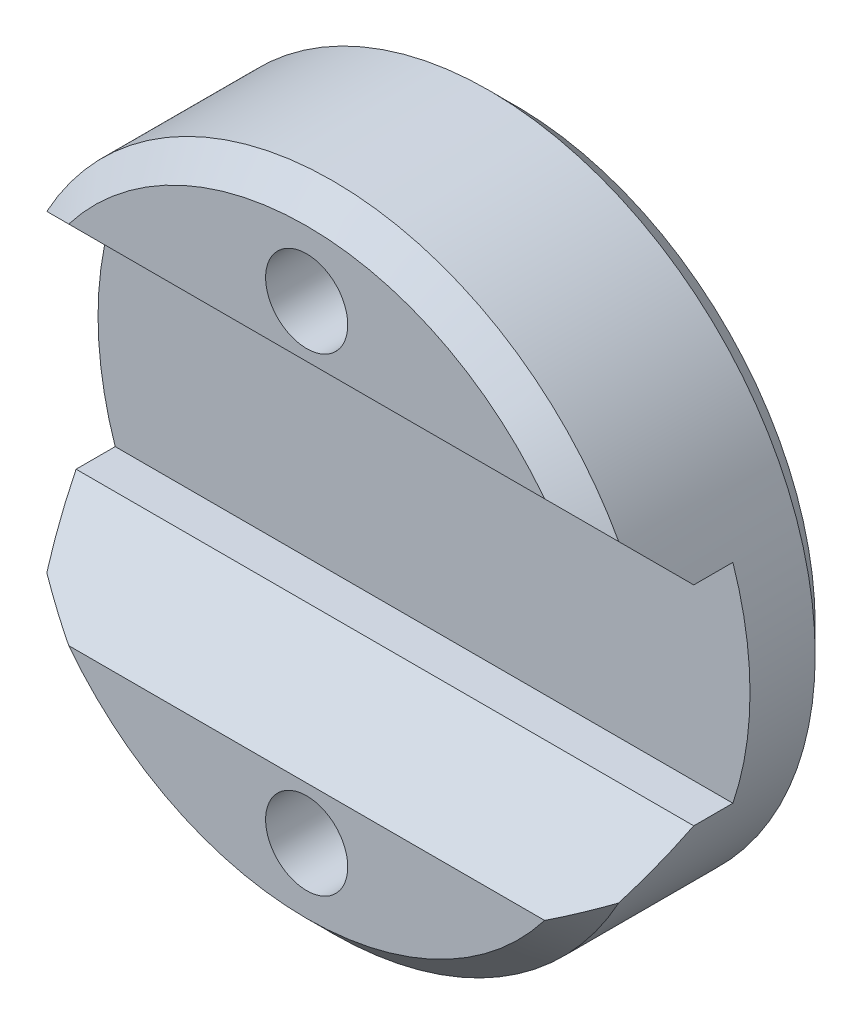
ISO-10303-21;
HEADER;
FILE_DESCRIPTION(('STEP AP214'),'2;1');
FILE_NAME('part.step','',(''),(''),'','','');
FILE_SCHEMA(('AUTOMOTIVE_DESIGN { 1 0 10303 214 1 1 1 1 }'));
ENDSEC;
DATA;
#1=APPLICATION_CONTEXT('core data for automotive mechanical design processes');
#2=APPLICATION_PROTOCOL_DEFINITION('international standard','automotive_design',2000,#1);
#3=PRODUCT_CONTEXT('',#1,'mechanical');
#4=PRODUCT('Part','Part','',(#3));
#5=PRODUCT_RELATED_PRODUCT_CATEGORY('part','',(#4));
#6=PRODUCT_DEFINITION_FORMATION('','',#4);
#7=PRODUCT_DEFINITION_CONTEXT('part definition',#1,'design');
#8=PRODUCT_DEFINITION('design','',#6,#7);
#9=PRODUCT_DEFINITION_SHAPE('','',#8);
#10=(LENGTH_UNIT() NAMED_UNIT(*) SI_UNIT(.MILLI.,.METRE.));
#11=(NAMED_UNIT(*) PLANE_ANGLE_UNIT() SI_UNIT($,.RADIAN.));
#12=(NAMED_UNIT(*) SI_UNIT($,.STERADIAN.) SOLID_ANGLE_UNIT());
#13=UNCERTAINTY_MEASURE_WITH_UNIT(LENGTH_MEASURE(1.E-05),#10,'distance_accuracy_value','');
#14=(GEOMETRIC_REPRESENTATION_CONTEXT(3) GLOBAL_UNCERTAINTY_ASSIGNED_CONTEXT((#13)) GLOBAL_UNIT_ASSIGNED_CONTEXT((#10,
#11,#12)) REPRESENTATION_CONTEXT('',''));
#15=CARTESIAN_POINT('',(0.,0.,0.));
#16=DIRECTION('',(0.,0.,1.));
#17=DIRECTION('',(1.,0.,0.));
#18=AXIS2_PLACEMENT_3D('',#15,#16,#17);
#19=CARTESIAN_POINT('',(0.,0.,16.));
#20=DIRECTION('',(0.,0.,1.));
#21=DIRECTION('',(1.,0.,0.));
#22=AXIS2_PLACEMENT_3D('',#19,#20,#21);
#23=PLANE('',#22);
#24=CARTESIAN_POINT('',(0.,0.,16.));
#25=DIRECTION('',(0.,0.,1.));
#26=DIRECTION('',(1.,0.,0.));
#27=AXIS2_PLACEMENT_3D('',#24,#25,#26);
#28=CIRCLE('',#27,23.);
#29=CARTESIAN_POINT('',(18.2482875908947,14.,16.));
#30=VERTEX_POINT('',#29);
#31=CARTESIAN_POINT('',(-18.2482875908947,14.,16.));
#32=VERTEX_POINT('',#31);
#33=EDGE_CURVE('E177',#30,#32,#28,.T.);
#34=ORIENTED_EDGE('',*,*,#33,.T.);
#35=DIRECTION('',(1.,0.,0.));
#36=VECTOR('',#35,1.);
#37=CARTESIAN_POINT('',(21.5638586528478,14.,16.));
#38=LINE('',#37,#36);
#39=EDGE_CURVE('E132',#32,#30,#38,.T.);
#40=ORIENTED_EDGE('',*,*,#39,.T.);
#41=EDGE_LOOP('',(#34,#40));
#42=FACE_BOUND('',#41,.T.);
#43=CARTESIAN_POINT('',(0.,18.,16.));
#44=DIRECTION('',(0.,0.,1.));
#45=DIRECTION('',(1.,0.,0.));
#46=AXIS2_PLACEMENT_3D('',#43,#44,#45);
#47=CIRCLE('',#46,3.15);
#48=CARTESIAN_POINT('',(3.15,18.,16.));
#49=VERTEX_POINT('',#48);
#50=EDGE_CURVE('E158',#49,#49,#47,.T.);
#51=ORIENTED_EDGE('',*,*,#50,.F.);
#52=EDGE_LOOP('',(#51));
#53=FACE_BOUND('',#52,.T.);
#54=ADVANCED_FACE('F41',(#42,#53),#23,.T.);
#55=CARTESIAN_POINT('',(0.,0.,16.));
#56=DIRECTION('',(0.,0.,-1.));
#57=DIRECTION('',(-1.,0.,0.));
#58=AXIS2_PLACEMENT_3D('',#55,#56,#57);
#59=CONICAL_SURFACE('',#58,23.,0.785398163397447);
#60=ORIENTED_EDGE('',*,*,#33,.F.);
#61=CARTESIAN_POINT('',(18.2482875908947,14.,16.));
#62=CARTESIAN_POINT('',(18.5659052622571,13.8433489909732,15.8433489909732));
#63=CARTESIAN_POINT('',(18.8808036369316,13.6839552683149,15.6839552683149));
#64=CARTESIAN_POINT('',(19.5051164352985,13.3601064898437,15.3601064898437));
#65=CARTESIAN_POINT('',(19.814533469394,13.1956539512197,15.1956539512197));
#66=CARTESIAN_POINT('',(20.428132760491,12.8619664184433,14.8619664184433));
#67=CARTESIAN_POINT('',(20.7323152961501,12.6927316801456,14.6927316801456));
#68=CARTESIAN_POINT('',(21.3357336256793,12.3496957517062,14.3496957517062));
#69=CARTESIAN_POINT('',(21.634966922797,12.1758923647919,14.1758923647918));
#70=CARTESIAN_POINT('',(21.9317121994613,12.,14.));
#71=B_SPLINE_CURVE_WITH_KNOTS('',3,(#61,#62,#63,#64,#65,#66,#67,#68,#69,#70),.UNSPECIFIED.,.F.,
.F.,(4,2,2,2,4),(0.,1.16169500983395,2.32282104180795,3.48388506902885,4.64551797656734),.UNSPECIFIED.);
#72=CARTESIAN_POINT('',(21.9317121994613,12.,14.));
#73=VERTEX_POINT('',#72);
#74=EDGE_CURVE('E195',#30,#73,#71,.T.);
#75=ORIENTED_EDGE('',*,*,#74,.T.);
#76=CARTESIAN_POINT('',(0.,0.,14.));
#77=DIRECTION('',(0.,0.,1.));
#78=DIRECTION('',(1.,0.,0.));
#79=AXIS2_PLACEMENT_3D('',#76,#77,#78);
#80=CIRCLE('',#79,25.);
#81=CARTESIAN_POINT('',(-21.9317121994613,12.,14.));
#82=VERTEX_POINT('',#81);
#83=EDGE_CURVE('E180',#82,#73,#80,.F.);
#84=ORIENTED_EDGE('',*,*,#83,.F.);
#85=CARTESIAN_POINT('',(-21.9317121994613,12.,14.));
#86=CARTESIAN_POINT('',(-21.634966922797,12.1758923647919,14.1758923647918));
#87=CARTESIAN_POINT('',(-21.3357336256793,12.3496957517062,14.3496957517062));
#88=CARTESIAN_POINT('',(-20.7323152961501,12.6927316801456,14.6927316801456));
#89=CARTESIAN_POINT('',(-20.428132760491,12.8619664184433,14.8619664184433));
#90=CARTESIAN_POINT('',(-19.814533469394,13.1956539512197,15.1956539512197));
#91=CARTESIAN_POINT('',(-19.5051164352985,13.3601064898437,15.3601064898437));
#92=CARTESIAN_POINT('',(-18.8808036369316,13.6839552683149,15.6839552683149));
#93=CARTESIAN_POINT('',(-18.5659052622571,13.8433489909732,15.8433489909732));
#94=CARTESIAN_POINT('',(-18.2482875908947,14.,16.));
#95=B_SPLINE_CURVE_WITH_KNOTS('',3,(#85,#86,#87,#88,#89,#90,#91,#92,#93,#94),.UNSPECIFIED.,.F.,
.F.,(4,2,2,2,4),(0.,1.16163290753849,2.32269693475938,3.48382296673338,4.64551797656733),.UNSPECIFIED.);
#96=EDGE_CURVE('E186',#82,#32,#95,.T.);
#97=ORIENTED_EDGE('',*,*,#96,.T.);
#98=EDGE_LOOP('',(#60,#75,#84,#97));
#99=FACE_BOUND('',#98,.T.);
#100=ADVANCED_FACE('F223',(#99),#59,.T.);
#101=CARTESIAN_POINT('',(0.,0.,16.));
#102=DIRECTION('',(0.,0.,-1.));
#103=DIRECTION('',(-1.,0.,0.));
#104=AXIS2_PLACEMENT_3D('',#101,#102,#103);
#105=CYLINDRICAL_SURFACE('',#104,25.);
#106=ORIENTED_EDGE('',*,*,#83,.T.);
#107=CARTESIAN_POINT('',(0.,0.,1.99999999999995));
#108=DIRECTION('',(0.,-0.707106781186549,0.707106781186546));
#109=DIRECTION('',(0.,-0.707106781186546,-0.707106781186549));
#110=AXIS2_PLACEMENT_3D('',#107,#108,#109);
#111=ELLIPSE('',#110,35.3553390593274,25.);
#112=CARTESIAN_POINT('',(23.685438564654,8.,9.99999999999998));
#113=VERTEX_POINT('',#112);
#114=EDGE_CURVE('E359',#73,#113,#111,.F.);
#115=ORIENTED_EDGE('',*,*,#114,.T.);
#116=DIRECTION('',(0.,0.,-1.));
#117=VECTOR('',#116,1.);
#118=CARTESIAN_POINT('',(23.685438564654,8.,16.));
#119=LINE('',#118,#117);
#120=CARTESIAN_POINT('',(23.685438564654,8.,7.));
#121=VERTEX_POINT('',#120);
#122=EDGE_CURVE('E147',#113,#121,#119,.T.);
#123=ORIENTED_EDGE('',*,*,#122,.T.);
#124=CARTESIAN_POINT('',(0.,0.,7.));
#125=DIRECTION('',(0.,0.,-1.));
#126=DIRECTION('',(0.,1.,0.));
#127=AXIS2_PLACEMENT_3D('',#124,#125,#126);
#128=CIRCLE('',#127,25.);
#129=CARTESIAN_POINT('',(23.685438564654,-8.,7.));
#130=VERTEX_POINT('',#129);
#131=EDGE_CURVE('E133',#121,#130,#128,.T.);
#132=ORIENTED_EDGE('',*,*,#131,.T.);
#133=DIRECTION('',(0.,0.,-1.));
#134=VECTOR('',#133,1.);
#135=CARTESIAN_POINT('',(23.685438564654,-8.,16.));
#136=LINE('',#135,#134);
#137=CARTESIAN_POINT('',(23.685438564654,-8.,9.99999999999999));
#138=VERTEX_POINT('',#137);
#139=EDGE_CURVE('E120',#130,#138,#136,.F.);
#140=ORIENTED_EDGE('',*,*,#139,.T.);
#141=CARTESIAN_POINT('',(0.,0.,2.00000000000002));
#142=DIRECTION('',(0.,0.707106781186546,0.707106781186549));
#143=DIRECTION('',(0.,0.707106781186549,-0.707106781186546));
#144=AXIS2_PLACEMENT_3D('',#141,#142,#143);
#145=ELLIPSE('',#144,35.3553390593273,25.);
#146=CARTESIAN_POINT('',(21.9317121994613,-12.,14.));
#147=VERTEX_POINT('',#146);
#148=EDGE_CURVE('E365',#138,#147,#145,.F.);
#149=ORIENTED_EDGE('',*,*,#148,.T.);
#150=CARTESIAN_POINT('',(-21.9317121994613,-12.,14.));
#151=VERTEX_POINT('',#150);
#152=EDGE_CURVE('E178',#147,#151,#80,.F.);
#153=ORIENTED_EDGE('',*,*,#152,.T.);
#154=CARTESIAN_POINT('',(0.,0.,2.00000000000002));
#155=DIRECTION('',(0.,0.707106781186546,0.707106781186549));
#156=DIRECTION('',(0.,0.707106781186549,-0.707106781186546));
#157=AXIS2_PLACEMENT_3D('',#154,#155,#156);
#158=ELLIPSE('',#157,35.3553390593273,25.);
#159=CARTESIAN_POINT('',(-23.685438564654,-8.,9.99999999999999));
#160=VERTEX_POINT('',#159);
#161=EDGE_CURVE('E113',#151,#160,#158,.F.);
#162=ORIENTED_EDGE('',*,*,#161,.T.);
#163=DIRECTION('',(0.,0.,-1.));
#164=VECTOR('',#163,1.);
#165=CARTESIAN_POINT('',(-23.685438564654,-8.,16.));
#166=LINE('',#165,#164);
#167=CARTESIAN_POINT('',(-23.685438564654,-8.,7.));
#168=VERTEX_POINT('',#167);
#169=EDGE_CURVE('E105',#160,#168,#166,.T.);
#170=ORIENTED_EDGE('',*,*,#169,.T.);
#171=CARTESIAN_POINT('',(-23.685438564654,8.,7.));
#172=VERTEX_POINT('',#171);
#173=EDGE_CURVE('E110',#168,#172,#128,.T.);
#174=ORIENTED_EDGE('',*,*,#173,.T.);
#175=DIRECTION('',(0.,0.,-1.));
#176=VECTOR('',#175,1.);
#177=CARTESIAN_POINT('',(-23.685438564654,8.,16.));
#178=LINE('',#177,#176);
#179=CARTESIAN_POINT('',(-23.685438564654,8.,9.99999999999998));
#180=VERTEX_POINT('',#179);
#181=EDGE_CURVE('E119',#172,#180,#178,.F.);
#182=ORIENTED_EDGE('',*,*,#181,.T.);
#183=CARTESIAN_POINT('',(0.,0.,1.99999999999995));
#184=DIRECTION('',(0.,-0.707106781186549,0.707106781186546));
#185=DIRECTION('',(0.,-0.707106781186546,-0.707106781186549));
#186=AXIS2_PLACEMENT_3D('',#183,#184,#185);
#187=ELLIPSE('',#186,35.3553390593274,25.);
#188=EDGE_CURVE('E362',#180,#82,#187,.F.);
#189=ORIENTED_EDGE('',*,*,#188,.T.);
#190=EDGE_LOOP('',(#106,#115,#123,#132,#140,#149,#153,#162,#170,#174,#182,#189));
#191=FACE_BOUND('',#190,.T.);
#192=CARTESIAN_POINT('',(0.,0.,2.00000000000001));
#193=DIRECTION('',(0.,0.,1.));
#194=DIRECTION('',(1.,0.,0.));
#195=AXIS2_PLACEMENT_3D('',#192,#193,#194);
#196=CIRCLE('',#195,25.);
#197=CARTESIAN_POINT('',(25.,0.,2.00000000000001));
#198=VERTEX_POINT('',#197);
#199=EDGE_CURVE('E166',#198,#198,#196,.T.);
#200=ORIENTED_EDGE('',*,*,#199,.T.);
#201=EDGE_LOOP('',(#200));
#202=FACE_BOUND('',#201,.T.);
#203=ADVANCED_FACE('F43',(#191,#202),#105,.T.);
#204=CARTESIAN_POINT('',(-18.2482875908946,-14.,16.));
#205=VERTEX_POINT('',#204);
#206=CARTESIAN_POINT('',(18.2482875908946,-14.,16.));
#207=VERTEX_POINT('',#206);
#208=EDGE_CURVE('E174',#205,#207,#28,.T.);
#209=ORIENTED_EDGE('',*,*,#208,.T.);
#210=DIRECTION('',(-1.,0.,0.));
#211=VECTOR('',#210,1.);
#212=CARTESIAN_POINT('',(-21.5638586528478,-14.,16.));
#213=LINE('',#212,#211);
#214=EDGE_CURVE('E11',#207,#205,#213,.T.);
#215=ORIENTED_EDGE('',*,*,#214,.T.);
#216=EDGE_LOOP('',(#209,#215));
#217=FACE_BOUND('',#216,.T.);
#218=CARTESIAN_POINT('',(0.,-18.,16.));
#219=DIRECTION('',(0.,0.,1.));
#220=DIRECTION('',(1.,0.,0.));
#221=AXIS2_PLACEMENT_3D('',#218,#219,#220);
#222=CIRCLE('',#221,3.15);
#223=CARTESIAN_POINT('',(3.15,-18.,16.));
#224=VERTEX_POINT('',#223);
#225=EDGE_CURVE('E150',#224,#224,#222,.T.);
#226=ORIENTED_EDGE('',*,*,#225,.F.);
#227=EDGE_LOOP('',(#226));
#228=FACE_BOUND('',#227,.T.);
#229=ADVANCED_FACE('F225',(#217,#228),#23,.T.);
#230=CARTESIAN_POINT('',(0.,0.,0.));
#231=DIRECTION('',(0.,0.,1.));
#232=DIRECTION('',(1.,0.,0.));
#233=AXIS2_PLACEMENT_3D('',#230,#231,#232);
#234=PLANE('',#233);
#235=CARTESIAN_POINT('',(0.,0.,0.));
#236=DIRECTION('',(0.,0.,1.));
#237=DIRECTION('',(1.,0.,0.));
#238=AXIS2_PLACEMENT_3D('',#235,#236,#237);
#239=CIRCLE('',#238,23.);
#240=CARTESIAN_POINT('',(23.,0.,0.));
#241=VERTEX_POINT('',#240);
#242=EDGE_CURVE('E170',#241,#241,#239,.F.);
#243=ORIENTED_EDGE('',*,*,#242,.T.);
#244=EDGE_LOOP('',(#243));
#245=FACE_BOUND('',#244,.T.);
#246=CARTESIAN_POINT('',(0.,-18.,0.));
#247=DIRECTION('',(0.,0.,1.));
#248=DIRECTION('',(1.,0.,0.));
#249=AXIS2_PLACEMENT_3D('',#246,#247,#248);
#250=CIRCLE('',#249,3.15);
#251=CARTESIAN_POINT('',(3.15,-18.,0.));
#252=VERTEX_POINT('',#251);
#253=EDGE_CURVE('E154',#252,#252,#250,.T.);
#254=ORIENTED_EDGE('',*,*,#253,.T.);
#255=EDGE_LOOP('',(#254));
#256=FACE_BOUND('',#255,.T.);
#257=CARTESIAN_POINT('',(0.,18.,0.));
#258=DIRECTION('',(0.,0.,1.));
#259=DIRECTION('',(1.,0.,0.));
#260=AXIS2_PLACEMENT_3D('',#257,#258,#259);
#261=CIRCLE('',#260,3.15);
#262=CARTESIAN_POINT('',(3.15,18.,0.));
#263=VERTEX_POINT('',#262);
#264=EDGE_CURVE('E162',#263,#263,#261,.T.);
#265=ORIENTED_EDGE('',*,*,#264,.T.);
#266=EDGE_LOOP('',(#265));
#267=FACE_BOUND('',#266,.T.);
#268=ADVANCED_FACE('F234',(#245,#256,#267),#234,.F.);
#269=CARTESIAN_POINT('',(0.,18.,0.));
#270=DIRECTION('',(0.,0.,1.));
#271=DIRECTION('',(1.,0.,0.));
#272=AXIS2_PLACEMENT_3D('',#269,#270,#271);
#273=CYLINDRICAL_SURFACE('',#272,3.15);
#274=ORIENTED_EDGE('',*,*,#264,.F.);
#275=EDGE_LOOP('',(#274));
#276=FACE_BOUND('',#275,.T.);
#277=ORIENTED_EDGE('',*,*,#50,.T.);
#278=EDGE_LOOP('',(#277));
#279=FACE_BOUND('',#278,.T.);
#280=ADVANCED_FACE('F239',(#276,#279),#273,.F.);
#281=CARTESIAN_POINT('',(0.,-18.,0.));
#282=DIRECTION('',(0.,0.,1.));
#283=DIRECTION('',(1.,0.,0.));
#284=AXIS2_PLACEMENT_3D('',#281,#282,#283);
#285=CYLINDRICAL_SURFACE('',#284,3.15);
#286=ORIENTED_EDGE('',*,*,#253,.F.);
#287=EDGE_LOOP('',(#286));
#288=FACE_BOUND('',#287,.T.);
#289=ORIENTED_EDGE('',*,*,#225,.T.);
#290=EDGE_LOOP('',(#289));
#291=FACE_BOUND('',#290,.T.);
#292=ADVANCED_FACE('F244',(#288,#291),#285,.F.);
#293=CARTESIAN_POINT('',(0.,0.,2.00000000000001));
#294=DIRECTION('',(0.,0.,1.));
#295=DIRECTION('',(1.,0.,0.));
#296=AXIS2_PLACEMENT_3D('',#293,#294,#295);
#297=CONICAL_SURFACE('',#296,25.,0.78539816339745);
#298=ORIENTED_EDGE('',*,*,#242,.F.);
#299=EDGE_LOOP('',(#298));
#300=FACE_BOUND('',#299,.T.);
#301=ORIENTED_EDGE('',*,*,#199,.F.);
#302=EDGE_LOOP('',(#301));
#303=FACE_BOUND('',#302,.T.);
#304=ADVANCED_FACE('F246',(#300,#303),#297,.T.);
#305=ORIENTED_EDGE('',*,*,#152,.F.);
#306=CARTESIAN_POINT('',(21.9317121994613,-12.,14.));
#307=CARTESIAN_POINT('',(21.634966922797,-12.1758923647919,14.1758923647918));
#308=CARTESIAN_POINT('',(21.3357336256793,-12.3496957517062,14.3496957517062));
#309=CARTESIAN_POINT('',(20.7323152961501,-12.6927316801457,14.6927316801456));
#310=CARTESIAN_POINT('',(20.428132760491,-12.8619664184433,14.8619664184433));
#311=CARTESIAN_POINT('',(19.814533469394,-13.1956539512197,15.1956539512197));
#312=CARTESIAN_POINT('',(19.5051164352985,-13.3601064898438,15.3601064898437));
#313=CARTESIAN_POINT('',(18.8808036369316,-13.6839552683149,15.6839552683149));
#314=CARTESIAN_POINT('',(18.565905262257,-13.8433489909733,15.8433489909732));
#315=CARTESIAN_POINT('',(18.2482875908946,-14.,16.));
#316=B_SPLINE_CURVE_WITH_KNOTS('',3,(#306,#307,#308,#309,#310,#311,#312,#313,#314,#315),
.UNSPECIFIED.,.F.,.F.,(4,2,2,2,4),(0.,1.1616329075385,2.32269693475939,3.4838229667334,
4.64551797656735),.UNSPECIFIED.);
#317=EDGE_CURVE('E50',#147,#207,#316,.T.);
#318=ORIENTED_EDGE('',*,*,#317,.T.);
#319=ORIENTED_EDGE('',*,*,#208,.F.);
#320=CARTESIAN_POINT('',(-18.2482875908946,-14.,16.));
#321=CARTESIAN_POINT('',(-18.565905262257,-13.8433489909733,15.8433489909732));
#322=CARTESIAN_POINT('',(-18.8808036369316,-13.6839552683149,15.6839552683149));
#323=CARTESIAN_POINT('',(-19.5051164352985,-13.3601064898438,15.3601064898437));
#324=CARTESIAN_POINT('',(-19.814533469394,-13.1956539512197,15.1956539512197));
#325=CARTESIAN_POINT('',(-20.428132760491,-12.8619664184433,14.8619664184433));
#326=CARTESIAN_POINT('',(-20.7323152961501,-12.6927316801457,14.6927316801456));
#327=CARTESIAN_POINT('',(-21.3357336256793,-12.3496957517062,14.3496957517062));
#328=CARTESIAN_POINT('',(-21.634966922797,-12.1758923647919,14.1758923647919));
#329=CARTESIAN_POINT('',(-21.9317121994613,-12.,14.));
#330=B_SPLINE_CURVE_WITH_KNOTS('',3,(#320,#321,#322,#323,#324,#325,#326,#327,#328,#329),
.UNSPECIFIED.,.F.,.F.,(4,2,2,2,4),(0.,1.16169500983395,2.32282104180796,3.48388506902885,
4.64551797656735),.UNSPECIFIED.);
#331=EDGE_CURVE('E339',#205,#151,#330,.T.);
#332=ORIENTED_EDGE('',*,*,#331,.T.);
#333=EDGE_LOOP('',(#305,#318,#319,#332));
#334=FACE_BOUND('',#333,.T.);
#335=ADVANCED_FACE('F201',(#334),#59,.T.);
#336=CARTESIAN_POINT('',(-50.,8.,7.));
#337=DIRECTION('',(0.,0.,-1.));
#338=DIRECTION('',(0.,1.,0.));
#339=AXIS2_PLACEMENT_3D('',#336,#337,#338);
#340=PLANE('',#339);
#341=DIRECTION('',(1.,0.,0.));
#342=VECTOR('',#341,1.);
#343=CARTESIAN_POINT('',(-50.,8.,7.));
#344=LINE('',#343,#342);
#345=EDGE_CURVE('E130',#172,#121,#344,.T.);
#346=ORIENTED_EDGE('',*,*,#345,.F.);
#347=ORIENTED_EDGE('',*,*,#173,.F.);
#348=DIRECTION('',(1.,0.,0.));
#349=VECTOR('',#348,1.);
#350=CARTESIAN_POINT('',(-50.,-8.,7.));
#351=LINE('',#350,#349);
#352=EDGE_CURVE('E127',#168,#130,#351,.T.);
#353=ORIENTED_EDGE('',*,*,#352,.T.);
#354=ORIENTED_EDGE('',*,*,#131,.F.);
#355=EDGE_LOOP('',(#346,#347,#353,#354));
#356=FACE_BOUND('',#355,.T.);
#357=ADVANCED_FACE('F125',(#356),#340,.F.);
#358=CARTESIAN_POINT('',(-50.,8.,16.));
#359=DIRECTION('',(0.,1.,0.));
#360=DIRECTION('',(0.,0.,1.));
#361=AXIS2_PLACEMENT_3D('',#358,#359,#360);
#362=PLANE('',#361);
#363=ORIENTED_EDGE('',*,*,#122,.F.);
#364=DIRECTION('',(-1.,0.,0.));
#365=VECTOR('',#364,1.);
#366=CARTESIAN_POINT('',(-21.5638586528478,8.,9.99999999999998));
#367=LINE('',#366,#365);
#368=EDGE_CURVE('E346',#113,#180,#367,.T.);
#369=ORIENTED_EDGE('',*,*,#368,.T.);
#370=ORIENTED_EDGE('',*,*,#181,.F.);
#371=ORIENTED_EDGE('',*,*,#345,.T.);
#372=EDGE_LOOP('',(#363,#369,#370,#371));
#373=FACE_BOUND('',#372,.T.);
#374=ADVANCED_FACE('F213',(#373),#362,.F.);
#375=CARTESIAN_POINT('',(-50.,-8.,16.));
#376=DIRECTION('',(0.,-1.,0.));
#377=DIRECTION('',(0.,0.,-1.));
#378=AXIS2_PLACEMENT_3D('',#375,#376,#377);
#379=PLANE('',#378);
#380=ORIENTED_EDGE('',*,*,#169,.F.);
#381=DIRECTION('',(1.,0.,0.));
#382=VECTOR('',#381,1.);
#383=CARTESIAN_POINT('',(21.5638586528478,-8.,9.99999999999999));
#384=LINE('',#383,#382);
#385=EDGE_CURVE('E341',#160,#138,#384,.T.);
#386=ORIENTED_EDGE('',*,*,#385,.T.);
#387=ORIENTED_EDGE('',*,*,#139,.F.);
#388=ORIENTED_EDGE('',*,*,#352,.F.);
#389=EDGE_LOOP('',(#380,#386,#387,#388));
#390=FACE_BOUND('',#389,.T.);
#391=ADVANCED_FACE('F135',(#390),#379,.F.);
#392=CARTESIAN_POINT('',(0.,14.,16.));
#393=DIRECTION('',(0.,-0.707106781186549,0.707106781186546));
#394=DIRECTION('',(0.,-0.707106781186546,-0.707106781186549));
#395=AXIS2_PLACEMENT_3D('',#392,#393,#394);
#396=PLANE('',#395);
#397=ORIENTED_EDGE('',*,*,#188,.F.);
#398=ORIENTED_EDGE('',*,*,#368,.F.);
#399=ORIENTED_EDGE('',*,*,#114,.F.);
#400=ORIENTED_EDGE('',*,*,#74,.F.);
#401=ORIENTED_EDGE('',*,*,#39,.F.);
#402=ORIENTED_EDGE('',*,*,#96,.F.);
#403=EDGE_LOOP('',(#397,#398,#399,#400,#401,#402));
#404=FACE_BOUND('',#403,.T.);
#405=ADVANCED_FACE('F205',(#404),#396,.T.);
#406=CARTESIAN_POINT('',(-50.,-8.,9.99999999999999));
#407=DIRECTION('',(0.,0.707106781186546,0.707106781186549));
#408=DIRECTION('',(0.,-0.707106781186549,0.707106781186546));
#409=AXIS2_PLACEMENT_3D('',#406,#407,#408);
#410=PLANE('',#409);
#411=ORIENTED_EDGE('',*,*,#331,.F.);
#412=ORIENTED_EDGE('',*,*,#214,.F.);
#413=ORIENTED_EDGE('',*,*,#317,.F.);
#414=ORIENTED_EDGE('',*,*,#148,.F.);
#415=ORIENTED_EDGE('',*,*,#385,.F.);
#416=ORIENTED_EDGE('',*,*,#161,.F.);
#417=EDGE_LOOP('',(#411,#412,#413,#414,#415,#416));
#418=FACE_BOUND('',#417,.T.);
#419=ADVANCED_FACE('F210',(#418),#410,.T.);
#420=CLOSED_SHELL('',(#54,#100,#203,#229,#268,#280,#292,#304,#335,#357,#374,#391,#405,#419));
#421=MANIFOLD_SOLID_BREP('B2',#420);
#422=ADVANCED_BREP_SHAPE_REPRESENTATION('',(#18,#421),#14);
#423=SHAPE_DEFINITION_REPRESENTATION(#9,#422);
ENDSEC;
END-ISO-10303-21;
